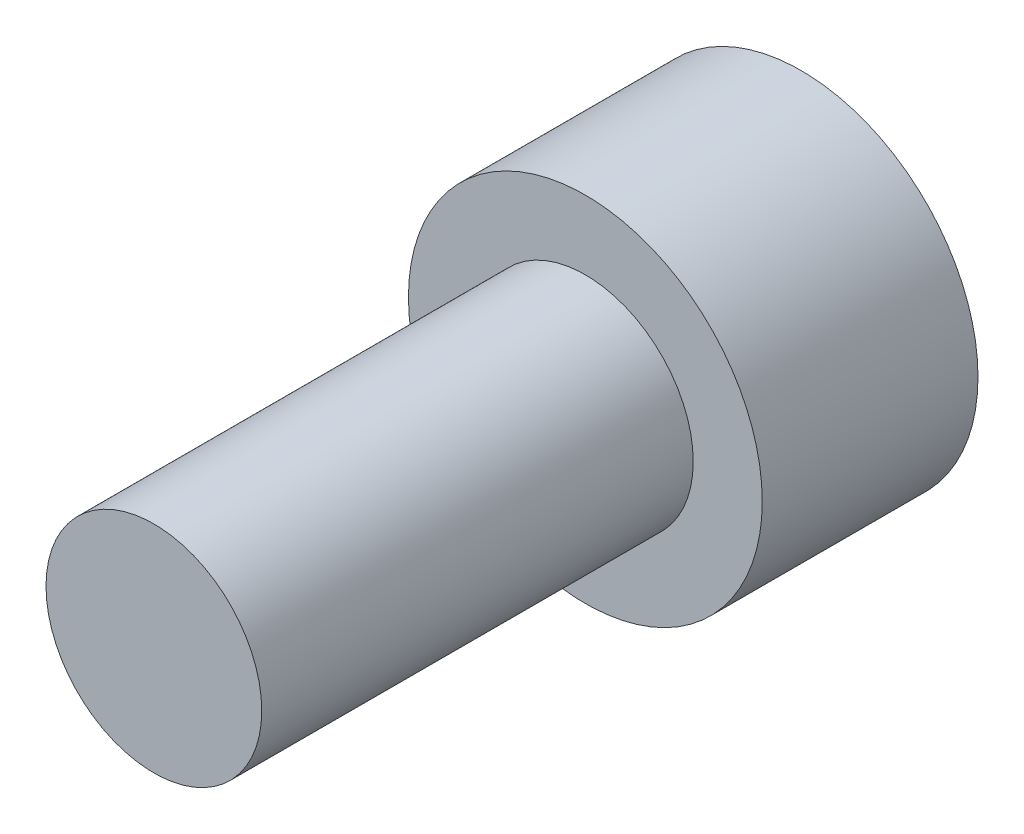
from build123d import *

# Parameters (mm, degrees)
HEX_2_DEPTH = 1.778


with BuildPart() as part:
    # Sketch6 → Revolve1 (revolve)
    with BuildSketch(Plane(origin=(0, 0, 0), x_dir=(0, 0, -1), z_dir=(1, 0, 0)), mode=Mode.PRIVATE) as revolve1_sk:
        Polygon((-6.35, 0), (-6.35, -1.5875), (0, -1.5875), (0, -2.6035), (3.175, -2.6035), (3.175, 0), align=None)
    revolve(revolve1_sk.sketch.rotate(Axis((0, 0, 6.35), (0, 0, -1)), 270), axis=Axis((0, 0, 6.35), (0, 0, -1)))

    # Sketch7 → HEX 2 (cut)
    with BuildSketch(Plane(origin=(0, 0, -3.175), x_dir=(-1, 0, 0), z_dir=(0, 0, -1))):
        Polygon((-1.1811, 0.681908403), (-1.1811, -0.681908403), (0, -1.363816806), (1.1811, -0.681908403), (1.1811, 0.681908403), (0, 1.363816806), align=None)
    extrude(amount=-HEX_2_DEPTH, mode=Mode.SUBTRACT)


solid = part.part
